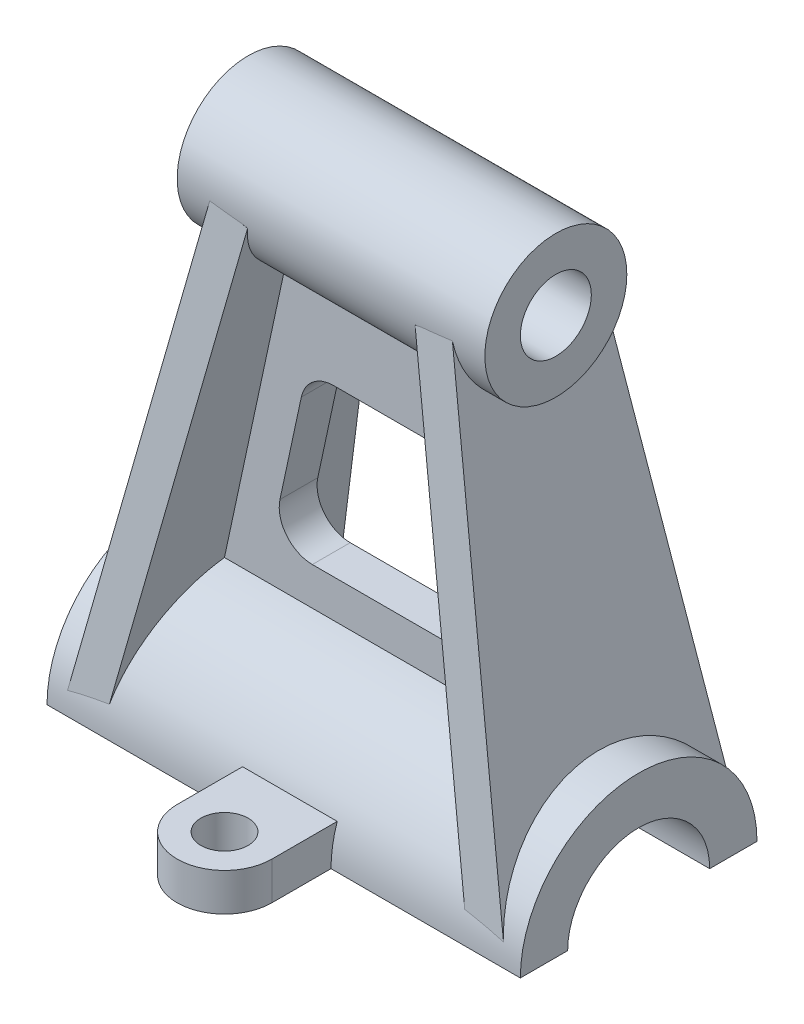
from build123d import *

# Parameters (mm, degrees)
BASE_EXTRUDE_DEPTH              = 50
BOSS_EXTRUDE1_DEPTH             = 8
SKETCH8_R                       = 15
BOSS_EXTRUDE2_DEPTH             = 32.5
BOSS_EXTRUDE3_REACH             = 129.867
SKETCH10_W                      = 8
SKETCH10_H                      = 100
BOSS_EXTRUDE3_DIRECTION_2_REACH = 129.867
CENTER_DEPTH                    = 128.867118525
CENTER_DEPTH_BACK               = 128.867118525
SKETCH13_W                      = 20
SKETCH13_H                      = 47.5
BOSS_EXTRUDE4_DEPTH             = 8
FILLET1_RADIUS                  = 10
FILLET1_LENGTH                  = 8
SKETCH16_R                      = 5
CUT_EXTRUDE4_DEPTH              = 135.047150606
SKETCH14_R                      = 15
CUT_EXTRUDE2_DEPTH              = 160.628474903
SKETCH15_R                      = 7.5
CUT_EXTRUDE3_DEPTH              = 138.914475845


with BuildPart() as part:
    # Sketch2 → Base-Extrude (new, symmetric)
    with BuildSketch(Plane(origin=(0, 0, 0), x_dir=(0, 0, -1), z_dir=(1, 0, 0))):
        with BuildLine():
            Line((-25, 0), (25, 0))
            ThreePointArc((25, 0), (0, 25), (-25, 0))
        make_face()
    extrude(amount=BASE_EXTRUDE_DEPTH, both=True)

    # Sketch6 → Boss-Extrude1 (add)
    with BuildSketch(Plane(origin=(44.923415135, 9.658534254, 0), x_dir=(0, 0, -1), z_dir=(0.9776591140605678, 0.21019670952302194, 0))):
        Polygon((-24.883629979, -8.15431418), (-14.930177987, 92.347831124), (14.930177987, 92.347831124), (24.883629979, -8.15431418), align=None)
    boss_extrude1 = extrude(amount=-BOSS_EXTRUDE1_DEPTH)

    # Sketch8 → Boss-Extrude2 (add, symmetric)
    with BuildSketch(Plane(origin=(0, 0, 0), x_dir=(0, 0, -1), z_dir=(1, 0, 0))):
        with Locations((0, 100)):
            Circle(SKETCH8_R)
    extrude(amount=BOSS_EXTRUDE2_DEPTH, both=True)

    # Mirror1: Boss-Extrude1 across plane
    add(boss_extrude1.mirror(Plane(origin=(0, 0, 0), x_dir=(0, 0, 1), z_dir=(1, 0, 0))))

    # Boss-Extrude3: up to this plane
    boss_extrude3_end = Plane(origin=(-38.816152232, 0.004821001, 24.883629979), z_dir=(-0.9776591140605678, 0.21019670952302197, 0))
    # Sketch10 → Boss-Extrude3 (add, up to the surface)
    with BuildSketch(Plane(origin=(0, 0, 0), x_dir=(0, 0, -1), z_dir=(1, 0, 0)), mode=Mode.PRIVATE) as boss_extrude3_sk1:
        with Locations((0, 50)):
            Rectangle(SKETCH10_W, SKETCH10_H)
    boss_extrude3_tool1 = split(extrude(boss_extrude3_sk1.sketch, amount=-BOSS_EXTRUDE3_REACH, mode=Mode.PRIVATE), bisect_by=boss_extrude3_end, keep=Keep.BOTH, mode=Mode.PRIVATE)
    add(boss_extrude3_tool1.solids().sort_by_distance((0, 50, 0))[0])

    # Boss-Extrude3 direction 2: up to this plane
    boss_extrude3_direction_2_end = Plane(origin=(38.816152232, 0.004821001, 24.883629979), z_dir=(0.9776591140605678, 0.21019670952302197, 0))
    # Sketch10 → Boss-Extrude3 direction 2 (add, up to the surface)
    with BuildSketch(Plane(origin=(0, 0, 0), x_dir=(0, 0, -1), z_dir=(1, 0, 0)), mode=Mode.PRIVATE) as boss_extrude3_direction_2_sk1:
        with Locations((0, 50)):
            Rectangle(SKETCH10_W, SKETCH10_H)
    boss_extrude3_direction_2_tool1 = split(extrude(boss_extrude3_direction_2_sk1.sketch, amount=BOSS_EXTRUDE3_DIRECTION_2_REACH, mode=Mode.PRIVATE), bisect_by=boss_extrude3_direction_2_end, keep=Keep.BOTH, mode=Mode.PRIVATE)
    add(boss_extrude3_direction_2_tool1.solids().sort_by_distance((0, 50, 0))[0])

    # Sketch12 → CENTER (cut, two sides: drawn at the far end of the back side and taken through both)
    with BuildSketch(Plane.XY.offset(-CENTER_DEPTH_BACK)):
        with BuildLine():
            Line((-17.272277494, 62.149302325), (-21.787277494, 41.149302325))
            ThreePointArc((-21.787277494, 41.149302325), (-20.388828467, 35.279041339), (-14.943663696, 32.677925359))
            Line((-14.943663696, 32.677925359), (14.943663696, 32.677925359))
            ThreePointArc((14.943663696, 32.677925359), (20.388828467, 35.279041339), (21.787277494, 41.149302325))
            Line((21.787277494, 41.149302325), (17.272277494, 62.149302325))
            ThreePointArc((17.272277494, 62.149302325), (14.827547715, 66.12309013), (10.428663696, 67.677925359))
            Line((10.428663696, 67.677925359), (-10.428663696, 67.677925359))
            ThreePointArc((-10.428663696, 67.677925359), (-14.827547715, 66.12309013), (-17.272277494, 62.149302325))
        make_face()
    extrude(amount=CENTER_DEPTH + CENTER_DEPTH_BACK, mode=Mode.SUBTRACT)

    # Sketch13 → Boss-Extrude4 (add)
    with BuildSketch(Plane.XZ):
        with Locations((0, 23.75)):
            Rectangle(SKETCH13_W, SKETCH13_H)
    extrude(amount=-BOSS_EXTRUDE4_DEPTH)

    # Fillet1: full round fillet: the end face becomes a half cylinder, R = half its width
    fillet1_face = Plane((0, 4, 47.5), x_dir=(0, 1, 0), z_dir=(0, 0, 1))  # on the end face: x along it, z out of the body
    fillet1_slab = fillet1_face.offset(-FILLET1_RADIUS / 2) * Box(FILLET1_LENGTH, 2 * FILLET1_RADIUS, FILLET1_RADIUS, mode=Mode.PRIVATE)  # the body's end, R deep
    fillet1_round = Plane((0, 4, 37.5), x_dir=(0, 0, 1), z_dir=(0, 1, 0)) * Cylinder(FILLET1_RADIUS, FILLET1_LENGTH, mode=Mode.PRIVATE)  # its axis R under the face
    add(fillet1_slab - fillet1_round, mode=Mode.SUBTRACT)

    # Sketch16 → Cut-Extrude4 (cut, through all)
    with BuildSketch(Plane(origin=(-4.712122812, 8, 34.382002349), x_dir=(-1, 0, 0), z_dir=(0, 1, 0))):
        with Locations(Location((-4.712122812, 3.117997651, 0), (0, 0, 90))):
            Circle(SKETCH16_R)
    extrude(amount=-CUT_EXTRUDE4_DEPTH, mode=Mode.SUBTRACT)

    # Sketch14 → Cut-Extrude2 (cut, through all)
    with BuildSketch(Plane(origin=(50, 0, 0), x_dir=(0, 0, -1), z_dir=(1, 0, 0))):
        Circle(SKETCH14_R)
    extrude(amount=-CUT_EXTRUDE2_DEPTH, mode=Mode.SUBTRACT)

    # Sketch15 → Cut-Extrude3 (cut, through all)
    with BuildSketch(Plane(origin=(32.5, 97.037091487, -5.395704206), x_dir=(0, 0, -1), z_dir=(1, 0, 0))):
        with Locations((-5.395704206, 2.962908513)):
            Circle(SKETCH15_R)
    extrude(amount=-CUT_EXTRUDE3_DEPTH, mode=Mode.SUBTRACT)


solid = part.part
